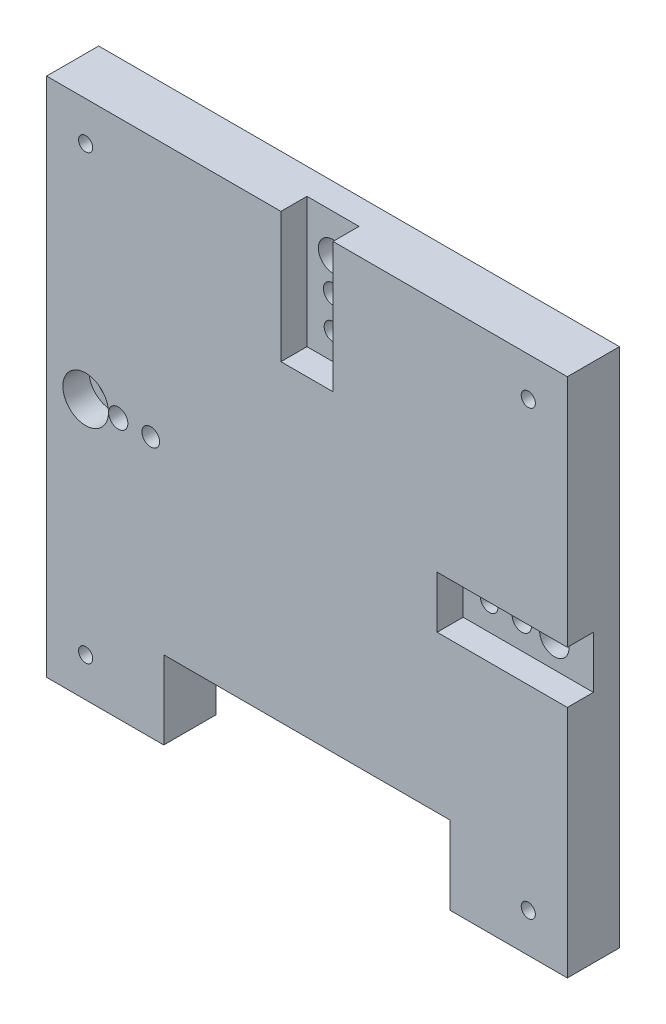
from build123d import *

# Parameters (mm, degrees)
SKETCH1_W                       = 127
SKETCH1_H                       = 127
BOSS_EXTRUDE1_DEPTH             = 12.7
F_18_0_1695_DIAMETER_HOLE1_D    = 4.3053
F_13_0_185_DIAMETER_HOLE1_D     = 4.699
F_9_32_0_28125_DIAMETER_HOLE1_D = 7.14375
F_8_32_TAPPED_HOLE1_D           = 3.4544
SKETCH10_R                      = 5.55625
SKETCH10_W                      = 31.75
SKETCH10_H                      = 12.7
SKETCH10_W_2                    = 12.7
SKETCH10_H_2                    = 31.75
CUT_EXTRUDE5_DEPTH              = 6.35
SKETCH12_W                      = 69.85
SKETCH12_H                      = 19.05
CUT_EXTRUDE6_DEPTH              = 127.640345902


with BuildPart() as part:
    # Sketch1 → Boss-Extrude1 (new body)
    with BuildSketch(Plane.XY):
        with Locations((11.797553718, -37.528538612)):
            Rectangle(SKETCH1_W, SKETCH1_H)
    extrude(amount=BOSS_EXTRUDE1_DEPTH)

    # 18 _0.1695_ Diameter Hole1 (through all)
    with Locations(Plane.XY.offset(12.7)):
        with Locations((-26.302446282, -37.528538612), (49.897553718, -37.528538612), (11.797553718, 0.571461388)):
            Hole(F_18_0_1695_DIAMETER_HOLE1_D / 2)

    # 13 _0.185_ Diameter Hole1 (through all)
    with Locations(Plane.XY.offset(12.7)):
        with Locations((-34.239946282, -37.528538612), (57.835053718, -37.528538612), (11.797553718, 8.508961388)):
            Hole(F_13_0_185_DIAMETER_HOLE1_D / 2)

    # 9_32 _0.28125_ Diameter Hole1 (through all)
    with Locations(Plane.XY.offset(12.7)):
        with Locations((-42.177446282, -37.528538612), (65.772553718, -37.528538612), (11.797553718, 16.446461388)):
            Hole(F_9_32_0_28125_DIAMETER_HOLE1_D / 2)

    # 8-32 Tapped Hole1 (through all)
    with Locations(Plane.XY.offset(12.7)):
        with Locations((-42.177446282, 16.446461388), (65.772553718, 16.446461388), (65.772553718, -91.503538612), (-42.177446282, -91.503538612)):
            Hole(F_8_32_TAPPED_HOLE1_D / 2)

    # Sketch10 → Cut-Extrude5 (cut)
    with BuildSketch(Plane.XY.offset(12.7)):
        with Locations((-42.177446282, -37.528538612)):
            Circle(SKETCH10_R)
        with Locations((59.422553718, -37.528538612)):
            Rectangle(SKETCH10_W, SKETCH10_H)
        with Locations((11.797553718, 10.096461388)):
            Rectangle(SKETCH10_W_2, SKETCH10_H_2)
    extrude(amount=-CUT_EXTRUDE5_DEPTH, mode=Mode.SUBTRACT)

    # Sketch12 → Cut-Extrude6 (cut, through all)
    with BuildSketch(Plane.XY.offset(12.7)):
        with Locations((11.797553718, -91.503538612)):
            Rectangle(SKETCH12_W, SKETCH12_H)
    extrude(amount=-CUT_EXTRUDE6_DEPTH, mode=Mode.SUBTRACT)


solid = part.part
